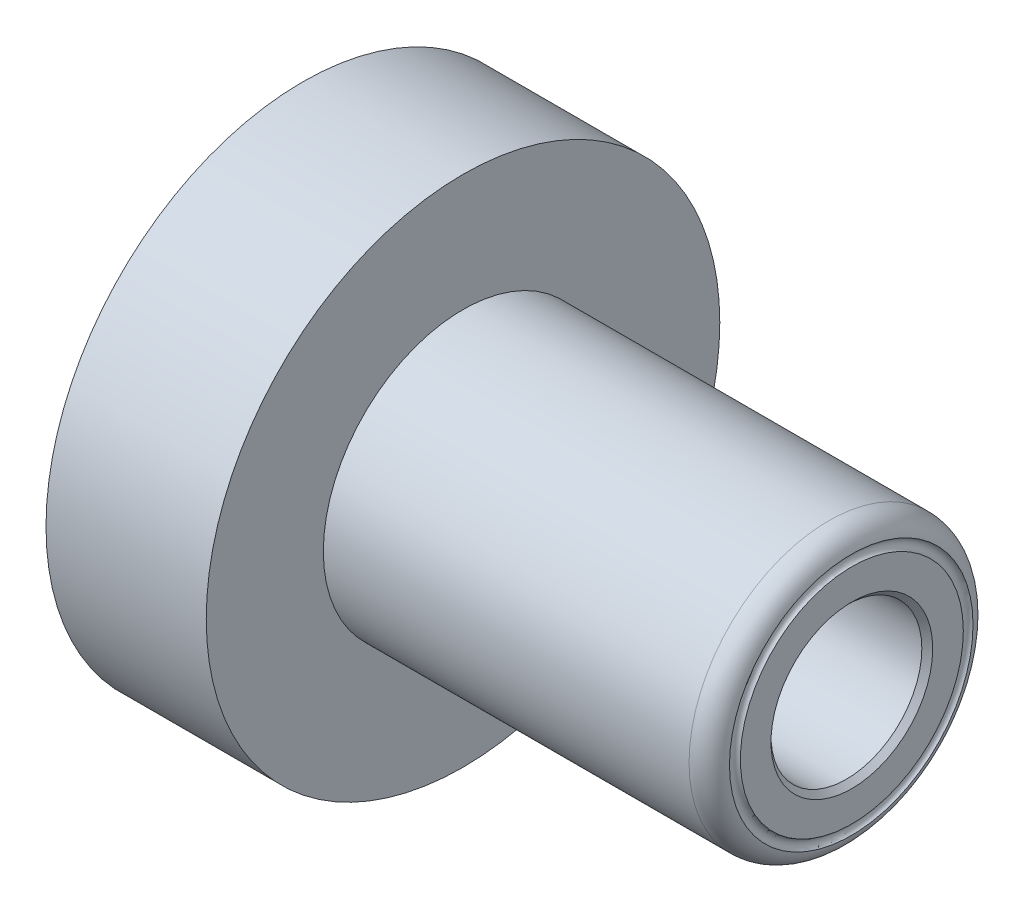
ISO-10303-21;
HEADER;
FILE_DESCRIPTION(('STEP AP214'),'2;1');
FILE_NAME('part.step','',(''),(''),'','','');
FILE_SCHEMA(('AUTOMOTIVE_DESIGN { 1 0 10303 214 1 1 1 1 }'));
ENDSEC;
DATA;
#1=APPLICATION_CONTEXT('core data for automotive mechanical design processes');
#2=APPLICATION_PROTOCOL_DEFINITION('international standard','automotive_design',2000,#1);
#3=PRODUCT_CONTEXT('',#1,'mechanical');
#4=PRODUCT('Part','Part','',(#3));
#5=PRODUCT_RELATED_PRODUCT_CATEGORY('part','',(#4));
#6=PRODUCT_DEFINITION_FORMATION('','',#4);
#7=PRODUCT_DEFINITION_CONTEXT('part definition',#1,'design');
#8=PRODUCT_DEFINITION('design','',#6,#7);
#9=PRODUCT_DEFINITION_SHAPE('','',#8);
#10=(LENGTH_UNIT() NAMED_UNIT(*) SI_UNIT(.MILLI.,.METRE.));
#11=(NAMED_UNIT(*) PLANE_ANGLE_UNIT() SI_UNIT($,.RADIAN.));
#12=(NAMED_UNIT(*) SI_UNIT($,.STERADIAN.) SOLID_ANGLE_UNIT());
#13=UNCERTAINTY_MEASURE_WITH_UNIT(LENGTH_MEASURE(1.E-05),#10,'distance_accuracy_value','');
#14=(GEOMETRIC_REPRESENTATION_CONTEXT(3) GLOBAL_UNCERTAINTY_ASSIGNED_CONTEXT((#13)) GLOBAL_UNIT_ASSIGNED_CONTEXT((#10,
#11,#12)) REPRESENTATION_CONTEXT('',''));
#15=CARTESIAN_POINT('',(0.,0.,0.));
#16=DIRECTION('',(0.,0.,1.));
#17=DIRECTION('',(1.,0.,0.));
#18=AXIS2_PLACEMENT_3D('',#15,#16,#17);
#19=CARTESIAN_POINT('',(37.338,7.9296,0.));
#20=DIRECTION('',(-1.,0.,0.));
#21=DIRECTION('',(0.,0.,1.));
#22=AXIS2_PLACEMENT_3D('',#19,#20,#21);
#23=PLANE('',#22);
#24=CARTESIAN_POINT('',(37.338,0.,0.));
#25=DIRECTION('',(-1.,0.,0.));
#26=DIRECTION('',(0.,0.,1.));
#27=AXIS2_PLACEMENT_3D('',#24,#25,#26);
#28=CIRCLE('',#27,5.49999999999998);
#29=CARTESIAN_POINT('',(37.338,0.,-5.49999999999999));
#30=VERTEX_POINT('',#29);
#31=EDGE_CURVE('E10',#30,#30,#28,.T.);
#32=ORIENTED_EDGE('',*,*,#31,.T.);
#33=EDGE_LOOP('',(#32));
#34=FACE_BOUND('',#33,.T.);
#35=CARTESIAN_POINT('',(37.338,0.,0.));
#36=DIRECTION('',(1.,0.,0.));
#37=DIRECTION('',(0.,0.,-1.));
#38=AXIS2_PLACEMENT_3D('',#35,#36,#37);
#39=CIRCLE('',#38,7.58150313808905);
#40=CARTESIAN_POINT('',(37.338,0.,-7.58150313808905));
#41=VERTEX_POINT('',#40);
#42=EDGE_CURVE('E78',#41,#41,#39,.F.);
#43=ORIENTED_EDGE('',*,*,#42,.F.);
#44=EDGE_LOOP('',(#43));
#45=FACE_BOUND('',#44,.T.);
#46=ADVANCED_FACE('F31',(#34,#45),#23,.F.);
#47=CARTESIAN_POINT('',(35.768,0.,0.));
#48=DIRECTION('',(-1.,0.,0.));
#49=DIRECTION('',(0.,0.,1.));
#50=AXIS2_PLACEMENT_3D('',#47,#48,#49);
#51=TOROIDAL_SURFACE('',#50,7.9296,1.57);
#52=CARTESIAN_POINT('',(35.768,0.,0.));
#53=DIRECTION('',(-1.,0.,0.));
#54=DIRECTION('',(0.,0.,1.));
#55=AXIS2_PLACEMENT_3D('',#52,#53,#54);
#56=CIRCLE('',#55,9.4996);
#57=CARTESIAN_POINT('',(35.768,0.,9.4996));
#58=VERTEX_POINT('',#57);
#59=EDGE_CURVE('E48',#58,#58,#56,.T.);
#60=ORIENTED_EDGE('',*,*,#59,.F.);
#61=EDGE_LOOP('',(#60));
#62=FACE_BOUND('',#61,.T.);
#63=CARTESIAN_POINT('',(37.2980555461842,0.,0.));
#64=DIRECTION('',(1.,0.,0.));
#65=DIRECTION('',(0.,0.,-1.));
#66=AXIS2_PLACEMENT_3D('',#63,#64,#65);
#67=CIRCLE('',#66,8.28149490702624);
#68=CARTESIAN_POINT('',(37.2980555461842,0.,-8.28149490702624));
#69=VERTEX_POINT('',#68);
#70=EDGE_CURVE('E35',#69,#69,#67,.T.);
#71=ORIENTED_EDGE('',*,*,#70,.F.);
#72=EDGE_LOOP('',(#71));
#73=FACE_BOUND('',#72,.T.);
#74=ADVANCED_FACE('F87',(#62,#73),#51,.T.);
#75=CARTESIAN_POINT('',(0.,0.,0.));
#76=DIRECTION('',(-1.,0.,0.));
#77=DIRECTION('',(0.,0.,1.));
#78=AXIS2_PLACEMENT_3D('',#75,#76,#77);
#79=CYLINDRICAL_SURFACE('',#78,6.7437);
#80=CARTESIAN_POINT('',(20.447,0.,0.));
#81=DIRECTION('',(-1.,0.,0.));
#82=DIRECTION('',(0.,0.,1.));
#83=AXIS2_PLACEMENT_3D('',#80,#81,#82);
#84=CIRCLE('',#83,6.7437);
#85=CARTESIAN_POINT('',(20.447,0.,6.7437));
#86=VERTEX_POINT('',#85);
#87=EDGE_CURVE('E43',#86,#86,#84,.T.);
#88=ORIENTED_EDGE('',*,*,#87,.F.);
#89=EDGE_LOOP('',(#88));
#90=FACE_BOUND('',#89,.T.);
#91=CARTESIAN_POINT('',(0.,0.,0.));
#92=DIRECTION('',(-1.,0.,0.));
#93=DIRECTION('',(0.,0.,1.));
#94=AXIS2_PLACEMENT_3D('',#91,#92,#93);
#95=CIRCLE('',#94,6.7437);
#96=CARTESIAN_POINT('',(0.,0.,6.7437));
#97=VERTEX_POINT('',#96);
#98=EDGE_CURVE('E60',#97,#97,#95,.T.);
#99=ORIENTED_EDGE('',*,*,#98,.T.);
#100=EDGE_LOOP('',(#99));
#101=FACE_BOUND('',#100,.T.);
#102=ADVANCED_FACE('F89',(#90,#101),#79,.F.);
#103=CARTESIAN_POINT('',(20.447,6.7437,0.));
#104=DIRECTION('',(1.,0.,0.));
#105=DIRECTION('',(0.,0.,-1.));
#106=AXIS2_PLACEMENT_3D('',#103,#104,#105);
#107=PLANE('',#106);
#108=CARTESIAN_POINT('',(20.447,0.,0.));
#109=DIRECTION('',(1.,0.,0.));
#110=DIRECTION('',(0.,0.,-1.));
#111=AXIS2_PLACEMENT_3D('',#108,#109,#110);
#112=CIRCLE('',#111,5.13);
#113=CARTESIAN_POINT('',(20.447,0.,-5.13));
#114=VERTEX_POINT('',#113);
#115=EDGE_CURVE('E73',#114,#114,#112,.T.);
#116=ORIENTED_EDGE('',*,*,#115,.T.);
#117=EDGE_LOOP('',(#116));
#118=FACE_BOUND('',#117,.T.);
#119=ORIENTED_EDGE('',*,*,#87,.T.);
#120=EDGE_LOOP('',(#119));
#121=FACE_BOUND('',#120,.T.);
#122=ADVANCED_FACE('F96',(#118,#121),#107,.F.);
#123=CARTESIAN_POINT('',(0.,0.,0.));
#124=DIRECTION('',(-1.,0.,0.));
#125=DIRECTION('',(0.,0.,1.));
#126=AXIS2_PLACEMENT_3D('',#123,#124,#125);
#127=CYLINDRICAL_SURFACE('',#126,9.4996);
#128=CARTESIAN_POINT('',(10.8966,0.,0.));
#129=DIRECTION('',(-1.,0.,0.));
#130=DIRECTION('',(0.,0.,1.));
#131=AXIS2_PLACEMENT_3D('',#128,#129,#130);
#132=CIRCLE('',#131,9.4996);
#133=CARTESIAN_POINT('',(10.8966,0.,9.4996));
#134=VERTEX_POINT('',#133);
#135=EDGE_CURVE('E51',#134,#134,#132,.T.);
#136=ORIENTED_EDGE('',*,*,#135,.F.);
#137=EDGE_LOOP('',(#136));
#138=FACE_BOUND('',#137,.T.);
#139=ORIENTED_EDGE('',*,*,#59,.T.);
#140=EDGE_LOOP('',(#139));
#141=FACE_BOUND('',#140,.T.);
#142=ADVANCED_FACE('F101',(#138,#141),#127,.T.);
#143=CARTESIAN_POINT('',(10.8966,17.4625,0.));
#144=DIRECTION('',(-1.,0.,0.));
#145=DIRECTION('',(0.,0.,1.));
#146=AXIS2_PLACEMENT_3D('',#143,#144,#145);
#147=PLANE('',#146);
#148=CARTESIAN_POINT('',(10.8966,0.,0.));
#149=DIRECTION('',(-1.,0.,0.));
#150=DIRECTION('',(0.,0.,1.));
#151=AXIS2_PLACEMENT_3D('',#148,#149,#150);
#152=CIRCLE('',#151,17.4625);
#153=CARTESIAN_POINT('',(10.8966,0.,17.4625));
#154=VERTEX_POINT('',#153);
#155=EDGE_CURVE('E54',#154,#154,#152,.T.);
#156=ORIENTED_EDGE('',*,*,#155,.F.);
#157=EDGE_LOOP('',(#156));
#158=FACE_BOUND('',#157,.T.);
#159=ORIENTED_EDGE('',*,*,#135,.T.);
#160=EDGE_LOOP('',(#159));
#161=FACE_BOUND('',#160,.T.);
#162=ADVANCED_FACE('F109',(#158,#161),#147,.F.);
#163=CARTESIAN_POINT('',(0.,0.,0.));
#164=DIRECTION('',(-1.,0.,0.));
#165=DIRECTION('',(0.,0.,1.));
#166=AXIS2_PLACEMENT_3D('',#163,#164,#165);
#167=CYLINDRICAL_SURFACE('',#166,17.4625);
#168=CARTESIAN_POINT('',(0.,0.,0.));
#169=DIRECTION('',(-1.,0.,0.));
#170=DIRECTION('',(0.,0.,1.));
#171=AXIS2_PLACEMENT_3D('',#168,#169,#170);
#172=CIRCLE('',#171,17.4625);
#173=CARTESIAN_POINT('',(0.,0.,17.4625));
#174=VERTEX_POINT('',#173);
#175=EDGE_CURVE('E57',#174,#174,#172,.T.);
#176=ORIENTED_EDGE('',*,*,#175,.F.);
#177=EDGE_LOOP('',(#176));
#178=FACE_BOUND('',#177,.T.);
#179=ORIENTED_EDGE('',*,*,#155,.T.);
#180=EDGE_LOOP('',(#179));
#181=FACE_BOUND('',#180,.T.);
#182=ADVANCED_FACE('F121',(#178,#181),#167,.T.);
#183=CARTESIAN_POINT('',(0.,6.7437,0.));
#184=DIRECTION('',(1.,0.,0.));
#185=DIRECTION('',(0.,0.,-1.));
#186=AXIS2_PLACEMENT_3D('',#183,#184,#185);
#187=PLANE('',#186);
#188=CARTESIAN_POINT('',(0.,0.,11.1125));
#189=DIRECTION('',(-1.,0.,0.));
#190=DIRECTION('',(0.,0.,-1.));
#191=AXIS2_PLACEMENT_3D('',#188,#189,#190);
#192=CIRCLE('',#191,1.6129);
#193=CARTESIAN_POINT('',(0.,0.,9.4996));
#194=VERTEX_POINT('',#193);
#195=EDGE_CURVE('E70',#194,#194,#192,.T.);
#196=ORIENTED_EDGE('',*,*,#195,.F.);
#197=EDGE_LOOP('',(#196));
#198=FACE_BOUND('',#197,.T.);
#199=CARTESIAN_POINT('',(0.,0.,-11.1125));
#200=DIRECTION('',(-1.,0.,0.));
#201=DIRECTION('',(0.,0.,1.));
#202=AXIS2_PLACEMENT_3D('',#199,#200,#201);
#203=CIRCLE('',#202,1.6129);
#204=CARTESIAN_POINT('',(0.,0.,-9.4996));
#205=VERTEX_POINT('',#204);
#206=EDGE_CURVE('E64',#205,#205,#203,.T.);
#207=ORIENTED_EDGE('',*,*,#206,.F.);
#208=EDGE_LOOP('',(#207));
#209=FACE_BOUND('',#208,.T.);
#210=ORIENTED_EDGE('',*,*,#98,.F.);
#211=EDGE_LOOP('',(#210));
#212=FACE_BOUND('',#211,.T.);
#213=ORIENTED_EDGE('',*,*,#175,.T.);
#214=EDGE_LOOP('',(#213));
#215=FACE_BOUND('',#214,.T.);
#216=ADVANCED_FACE('F117',(#198,#209,#212,#215),#187,.F.);
#217=CARTESIAN_POINT('',(6.35,0.,-11.1125));
#218=DIRECTION('',(-1.,0.,0.));
#219=DIRECTION('',(0.,0.,1.));
#220=AXIS2_PLACEMENT_3D('',#217,#218,#219);
#221=CYLINDRICAL_SURFACE('',#220,1.6129);
#222=CARTESIAN_POINT('',(6.35,0.,-11.1125));
#223=DIRECTION('',(-1.,0.,0.));
#224=DIRECTION('',(0.,0.,1.));
#225=AXIS2_PLACEMENT_3D('',#222,#223,#224);
#226=CIRCLE('',#225,1.6129);
#227=CARTESIAN_POINT('',(6.35,0.,-9.4996));
#228=VERTEX_POINT('',#227);
#229=EDGE_CURVE('E63',#228,#228,#226,.T.);
#230=ORIENTED_EDGE('',*,*,#229,.F.);
#231=EDGE_LOOP('',(#230));
#232=FACE_BOUND('',#231,.T.);
#233=ORIENTED_EDGE('',*,*,#206,.T.);
#234=EDGE_LOOP('',(#233));
#235=FACE_BOUND('',#234,.T.);
#236=ADVANCED_FACE('F120',(#232,#235),#221,.F.);
#237=CARTESIAN_POINT('',(6.35,0.,-11.1125));
#238=DIRECTION('',(-1.,0.,0.));
#239=DIRECTION('',(0.,0.,1.));
#240=AXIS2_PLACEMENT_3D('',#237,#238,#239);
#241=PLANE('',#240);
#242=ORIENTED_EDGE('',*,*,#229,.T.);
#243=EDGE_LOOP('',(#242));
#244=FACE_BOUND('',#243,.T.);
#245=ADVANCED_FACE('F140',(#244),#241,.T.);
#246=CARTESIAN_POINT('',(6.35,0.,11.1125));
#247=DIRECTION('',(-1.,0.,0.));
#248=DIRECTION('',(0.,0.,1.));
#249=AXIS2_PLACEMENT_3D('',#246,#247,#248);
#250=CYLINDRICAL_SURFACE('',#249,1.6129);
#251=CARTESIAN_POINT('',(6.35,0.,11.1125));
#252=DIRECTION('',(-1.,0.,0.));
#253=DIRECTION('',(0.,0.,-1.));
#254=AXIS2_PLACEMENT_3D('',#251,#252,#253);
#255=CIRCLE('',#254,1.6129);
#256=CARTESIAN_POINT('',(6.35,0.,9.4996));
#257=VERTEX_POINT('',#256);
#258=EDGE_CURVE('E67',#257,#257,#255,.T.);
#259=ORIENTED_EDGE('',*,*,#258,.F.);
#260=EDGE_LOOP('',(#259));
#261=FACE_BOUND('',#260,.T.);
#262=ORIENTED_EDGE('',*,*,#195,.T.);
#263=EDGE_LOOP('',(#262));
#264=FACE_BOUND('',#263,.T.);
#265=ADVANCED_FACE('F144',(#261,#264),#250,.F.);
#266=CARTESIAN_POINT('',(6.35,0.,11.1125));
#267=DIRECTION('',(1.,0.,0.));
#268=DIRECTION('',(0.,0.,-1.));
#269=AXIS2_PLACEMENT_3D('',#266,#267,#268);
#270=PLANE('',#269);
#271=ORIENTED_EDGE('',*,*,#258,.T.);
#272=EDGE_LOOP('',(#271));
#273=FACE_BOUND('',#272,.T.);
#274=ADVANCED_FACE('F148',(#273),#270,.F.);
#275=CARTESIAN_POINT('',(0.,0.,0.));
#276=DIRECTION('',(1.,0.,0.));
#277=DIRECTION('',(0.,0.,-1.));
#278=AXIS2_PLACEMENT_3D('',#275,#276,#277);
#279=CYLINDRICAL_SURFACE('',#278,5.13);
#280=CARTESIAN_POINT('',(36.968,0.,0.));
#281=DIRECTION('',(-1.,0.,0.));
#282=DIRECTION('',(0.,0.,1.));
#283=AXIS2_PLACEMENT_3D('',#280,#281,#282);
#284=CIRCLE('',#283,5.13);
#285=CARTESIAN_POINT('',(36.968,0.,-5.13));
#286=VERTEX_POINT('',#285);
#287=EDGE_CURVE('E39',#286,#286,#284,.F.);
#288=ORIENTED_EDGE('',*,*,#287,.T.);
#289=EDGE_LOOP('',(#288));
#290=FACE_BOUND('',#289,.T.);
#291=ORIENTED_EDGE('',*,*,#115,.F.);
#292=EDGE_LOOP('',(#291));
#293=FACE_BOUND('',#292,.T.);
#294=ADVANCED_FACE('F152',(#290,#293),#279,.F.);
#295=CARTESIAN_POINT('',(36.968,0.,0.));
#296=DIRECTION('',(1.,0.,0.));
#297=DIRECTION('',(0.,0.,-1.));
#298=AXIS2_PLACEMENT_3D('',#295,#296,#297);
#299=CONICAL_SURFACE('',#298,5.13,0.785398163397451);
#300=CARTESIAN_POINT('',(37.338,0.,-5.49999999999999));
#301=CARTESIAN_POINT('',(37.3341458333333,0.,-5.49614583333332));
#302=CARTESIAN_POINT('',(37.3302916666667,0.,-5.49229166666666));
#303=CARTESIAN_POINT('',(37.3225833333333,0.,-5.48458333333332));
#304=CARTESIAN_POINT('',(37.3187291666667,0.,-5.48072916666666));
#305=CARTESIAN_POINT('',(37.3110208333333,0.,-5.47302083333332));
#306=CARTESIAN_POINT('',(37.3071666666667,0.,-5.46916666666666));
#307=CARTESIAN_POINT('',(37.2994583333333,0.,-5.46145833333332));
#308=CARTESIAN_POINT('',(37.2956041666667,0.,-5.45760416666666));
#309=CARTESIAN_POINT('',(37.2878958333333,0.,-5.44989583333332));
#310=CARTESIAN_POINT('',(37.2840416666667,0.,-5.44604166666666));
#311=CARTESIAN_POINT('',(37.2763333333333,0.,-5.43833333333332));
#312=CARTESIAN_POINT('',(37.2724791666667,0.,-5.43447916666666));
#313=CARTESIAN_POINT('',(37.2647708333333,0.,-5.42677083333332));
#314=CARTESIAN_POINT('',(37.2609166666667,0.,-5.42291666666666));
#315=CARTESIAN_POINT('',(37.2532083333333,0.,-5.41520833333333));
#316=CARTESIAN_POINT('',(37.2493541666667,0.,-5.41135416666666));
#317=CARTESIAN_POINT('',(37.2416458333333,0.,-5.40364583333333));
#318=CARTESIAN_POINT('',(37.2377916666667,0.,-5.39979166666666));
#319=CARTESIAN_POINT('',(37.2300833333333,0.,-5.39208333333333));
#320=CARTESIAN_POINT('',(37.2262291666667,0.,-5.38822916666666));
#321=CARTESIAN_POINT('',(37.2185208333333,0.,-5.38052083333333));
#322=CARTESIAN_POINT('',(37.2146666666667,0.,-5.37666666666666));
#323=CARTESIAN_POINT('',(37.2069583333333,0.,-5.36895833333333));
#324=CARTESIAN_POINT('',(37.2031041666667,0.,-5.36510416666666));
#325=CARTESIAN_POINT('',(37.1953958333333,0.,-5.35739583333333));
#326=CARTESIAN_POINT('',(37.1915416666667,0.,-5.35354166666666));
#327=CARTESIAN_POINT('',(37.1838333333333,0.,-5.34583333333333));
#328=CARTESIAN_POINT('',(37.1799791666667,0.,-5.34197916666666));
#329=CARTESIAN_POINT('',(37.1722708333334,0.,-5.33427083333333));
#330=CARTESIAN_POINT('',(37.1684166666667,0.,-5.33041666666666));
#331=CARTESIAN_POINT('',(37.1607083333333,0.,-5.32270833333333));
#332=CARTESIAN_POINT('',(37.1568541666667,0.,-5.31885416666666));
#333=CARTESIAN_POINT('',(37.1491458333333,0.,-5.31114583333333));
#334=CARTESIAN_POINT('',(37.1452916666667,0.,-5.30729166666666));
#335=CARTESIAN_POINT('',(37.1375833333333,0.,-5.29958333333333));
#336=CARTESIAN_POINT('',(37.1337291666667,0.,-5.29572916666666));
#337=CARTESIAN_POINT('',(37.1260208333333,0.,-5.28802083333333));
#338=CARTESIAN_POINT('',(37.1221666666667,0.,-5.28416666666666));
#339=CARTESIAN_POINT('',(37.1144583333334,0.,-5.27645833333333));
#340=CARTESIAN_POINT('',(37.1106041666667,0.,-5.27260416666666));
#341=CARTESIAN_POINT('',(37.1028958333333,0.,-5.26489583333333));
#342=CARTESIAN_POINT('',(37.0990416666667,0.,-5.26104166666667));
#343=CARTESIAN_POINT('',(37.0913333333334,0.,-5.25333333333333));
#344=CARTESIAN_POINT('',(37.0874791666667,0.,-5.24947916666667));
#345=CARTESIAN_POINT('',(37.0797708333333,0.,-5.24177083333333));
#346=CARTESIAN_POINT('',(37.0759166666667,0.,-5.23791666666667));
#347=CARTESIAN_POINT('',(37.0682083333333,0.,-5.23020833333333));
#348=CARTESIAN_POINT('',(37.0643541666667,0.,-5.22635416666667));
#349=CARTESIAN_POINT('',(37.0566458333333,0.,-5.21864583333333));
#350=CARTESIAN_POINT('',(37.0527916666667,0.,-5.21479166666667));
#351=CARTESIAN_POINT('',(37.0450833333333,0.,-5.20708333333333));
#352=CARTESIAN_POINT('',(37.0412291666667,0.,-5.20322916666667));
#353=CARTESIAN_POINT('',(37.0335208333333,0.,-5.19552083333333));
#354=CARTESIAN_POINT('',(37.0296666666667,0.,-5.19166666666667));
#355=CARTESIAN_POINT('',(37.0219583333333,0.,-5.18395833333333));
#356=CARTESIAN_POINT('',(37.0181041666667,0.,-5.18010416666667));
#357=CARTESIAN_POINT('',(37.0103958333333,0.,-5.17239583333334));
#358=CARTESIAN_POINT('',(37.0065416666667,0.,-5.16854166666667));
#359=CARTESIAN_POINT('',(36.9988333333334,0.,-5.16083333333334));
#360=CARTESIAN_POINT('',(36.9949791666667,0.,-5.15697916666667));
#361=CARTESIAN_POINT('',(36.9872708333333,0.,-5.14927083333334));
#362=CARTESIAN_POINT('',(36.9834166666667,0.,-5.14541666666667));
#363=CARTESIAN_POINT('',(36.9757083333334,0.,-5.13770833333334));
#364=CARTESIAN_POINT('',(36.9718541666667,0.,-5.13385416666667));
#365=CARTESIAN_POINT('',(36.968,0.,-5.13));
#366=B_SPLINE_CURVE_WITH_KNOTS('',3,(#300,#301,#302,#303,#304,#305,#306,#307,#308,#309,#310,
#311,#312,#313,#314,#315,#316,#317,#318,#319,#320,#321,#322,#323,#324,#325,#326,#327,#328,#329,
#330,#331,#332,#333,#334,#335,#336,#337,#338,#339,#340,#341,#342,#343,#344,#345,#346,#347,#348,
#349,#350,#351,#352,#353,#354,#355,#356,#357,#358,#359,#360,#361,#362,#363,#364,#365),
.UNSPECIFIED.,.F.,.F.,(4,2,2,2,2,2,2,2,2,2,2,2,2,2,2,2,2,2,2,2,2,2,2,2,2,2,2,2,2,2,2,2,4),(0.,
0.0163518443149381,0.0327036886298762,0.0490555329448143,0.0654073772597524,0.0817592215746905,
0.0981110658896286,0.114462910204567,0.130814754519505,0.147166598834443,0.163518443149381,
0.17987028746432,0.196222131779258,0.212573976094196,0.228925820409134,0.245277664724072,
0.26162950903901,0.277981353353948,0.294333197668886,0.310685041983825,0.327036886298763,
0.343388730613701,0.359740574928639,0.376092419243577,0.392444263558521,0.408796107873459,
0.425147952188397,0.441499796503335,0.457851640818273,0.474203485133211,0.490555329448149,
0.506907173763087,0.523259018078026),.UNSPECIFIED.);
#367=EDGE_CURVE('BSEAM33',#30,#286,#366,.T.);
#368=ORIENTED_EDGE('',*,*,#31,.F.);
#369=ORIENTED_EDGE('',*,*,#287,.F.);
#370=ORIENTED_EDGE('',*,*,#367,.T.);
#371=ORIENTED_EDGE('',*,*,#367,.F.);
#372=EDGE_LOOP('',(#368,#370,#369,#371));
#373=FACE_BOUND('',#372,.T.);
#374=ADVANCED_FACE('F33',(#373),#299,.F.);
#375=CARTESIAN_POINT('',(37.467,0.,0.));
#376=DIRECTION('',(-1.,0.,0.));
#377=DIRECTION('',(0.,0.,1.));
#378=AXIS2_PLACEMENT_3D('',#375,#376,#377);
#379=TOROIDAL_SURFACE('',#378,7.94,0.381000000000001);
#380=ORIENTED_EDGE('',*,*,#70,.T.);
#381=EDGE_LOOP('',(#380));
#382=FACE_BOUND('',#381,.T.);
#383=ORIENTED_EDGE('',*,*,#42,.T.);
#384=EDGE_LOOP('',(#383));
#385=FACE_BOUND('',#384,.T.);
#386=ADVANCED_FACE('F85',(#382,#385),#379,.F.);
#387=CLOSED_SHELL('',(#46,#74,#102,#122,#142,#162,#182,#216,#236,#245,#265,#274,#294,#374,#386));
#388=MANIFOLD_SOLID_BREP('B2',#387);
#389=ADVANCED_BREP_SHAPE_REPRESENTATION('',(#18,#388),#14);
#390=SHAPE_DEFINITION_REPRESENTATION(#9,#389);
ENDSEC;
END-ISO-10303-21;
